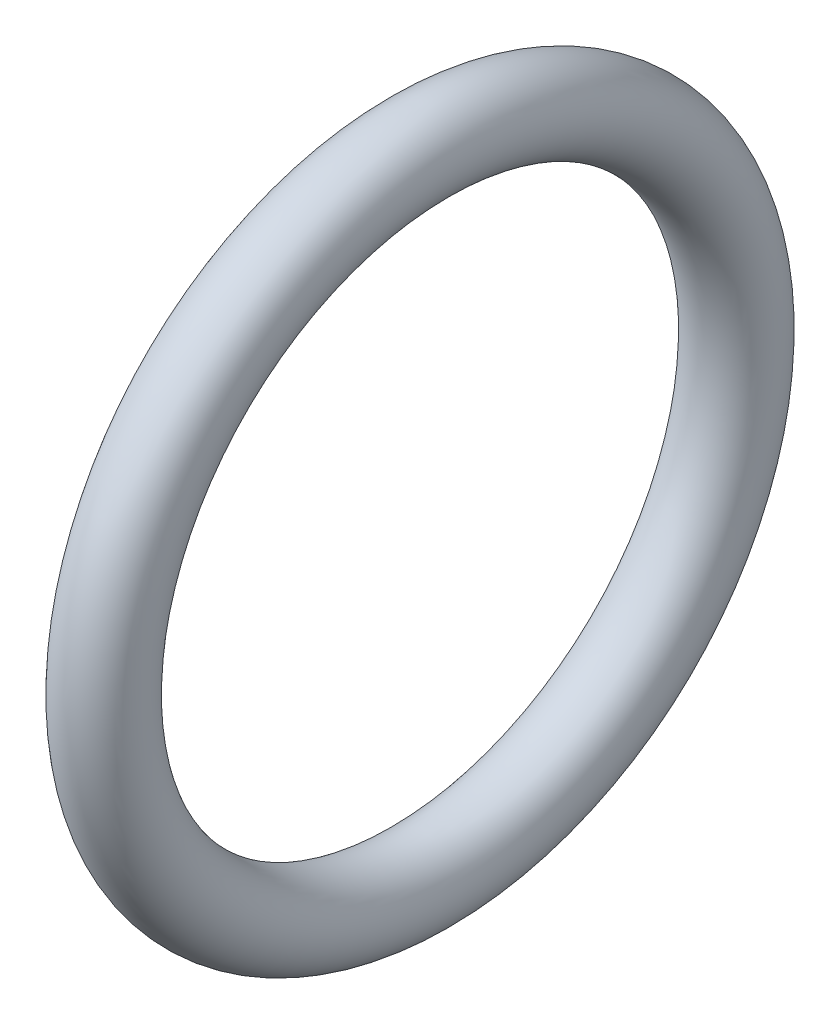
ISO-10303-21;
HEADER;
FILE_DESCRIPTION(('STEP AP214'),'2;1');
FILE_NAME('part.step','',(''),(''),'','','');
FILE_SCHEMA(('AUTOMOTIVE_DESIGN { 1 0 10303 214 1 1 1 1 }'));
ENDSEC;
DATA;
#1=APPLICATION_CONTEXT('core data for automotive mechanical design processes');
#2=APPLICATION_PROTOCOL_DEFINITION('international standard','automotive_design',2000,#1);
#3=PRODUCT_CONTEXT('',#1,'mechanical');
#4=PRODUCT('Part','Part','',(#3));
#5=PRODUCT_RELATED_PRODUCT_CATEGORY('part','',(#4));
#6=PRODUCT_DEFINITION_FORMATION('','',#4);
#7=PRODUCT_DEFINITION_CONTEXT('part definition',#1,'design');
#8=PRODUCT_DEFINITION('design','',#6,#7);
#9=PRODUCT_DEFINITION_SHAPE('','',#8);
#10=(LENGTH_UNIT() NAMED_UNIT(*) SI_UNIT(.MILLI.,.METRE.));
#11=(NAMED_UNIT(*) PLANE_ANGLE_UNIT() SI_UNIT($,.RADIAN.));
#12=(NAMED_UNIT(*) SI_UNIT($,.STERADIAN.) SOLID_ANGLE_UNIT());
#13=UNCERTAINTY_MEASURE_WITH_UNIT(LENGTH_MEASURE(1.E-05),#10,'distance_accuracy_value','');
#14=(GEOMETRIC_REPRESENTATION_CONTEXT(3) GLOBAL_UNCERTAINTY_ASSIGNED_CONTEXT((#13)) GLOBAL_UNIT_ASSIGNED_CONTEXT((#10,
#11,#12)) REPRESENTATION_CONTEXT('',''));
#15=CARTESIAN_POINT('',(0.,0.,0.));
#16=DIRECTION('',(0.,0.,1.));
#17=DIRECTION('',(1.,0.,0.));
#18=AXIS2_PLACEMENT_3D('',#15,#16,#17);
#19=CARTESIAN_POINT('',(25.6548023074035,0.,0.));
#20=DIRECTION('',(-1.,0.,0.));
#21=DIRECTION('',(0.,-1.,0.));
#22=AXIS2_PLACEMENT_3D('',#19,#20,#21);
#23=TOROIDAL_SURFACE('',#22,3.44519769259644,0.445197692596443);
#24=CARTESIAN_POINT('',(25.6548023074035,-3.89039538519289,0.));
#25=VERTEX_POINT('',#24);
#26=VERTEX_LOOP('',#25);
#27=FACE_BOUND('',#26,.T.);
#28=ADVANCED_FACE('F346',(#27),#23,.T.);
#29=CLOSED_SHELL('',(#28));
#30=MANIFOLD_SOLID_BREP('B2',#29);
#31=ADVANCED_BREP_SHAPE_REPRESENTATION('',(#18,#30),#14);
#32=SHAPE_DEFINITION_REPRESENTATION(#9,#31);
ENDSEC;
END-ISO-10303-21;
